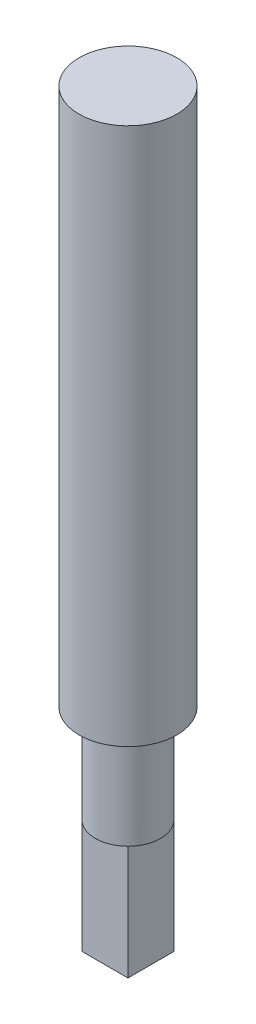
from build123d import *

# Parameters (mm, degrees)
SKETCH3_R           = 1.5
BOSS_EXTRUDE2_DEPTH = 16.5
SKETCH6_W           = 1
SKETCH6_H           = 4.5
CUT_EXTRUDE2_DEPTH  = 1
SKETCH7_R           = 1
BOSS_EXTRUDE3_DEPTH = 6.5
CUT_EXTRUDE3_START  = -3.5
CUT_EXTRUDE3_DEPTH  = 3.5


with BuildPart() as part:
    # Sketch3 → Boss-Extrude2 (new body)
    with BuildSketch(Plane(origin=(0, 0, 0), x_dir=(1, 0, 0), z_dir=(0, 1, 0))):
        with Locations(Location((1.5, 0, 0), (0, 0, 270))):
            Circle(SKETCH3_R)
    extrude(amount=BOSS_EXTRUDE2_DEPTH)

    # Sketch6 → Cut-Extrude2 (cut)
    with BuildSketch(Plane(origin=(0, 0, 0), x_dir=(0, 0, -1), z_dir=(1, 0, 0))):
        with Locations((0, 11.25)):
            Rectangle(SKETCH6_W, SKETCH6_H)
    extrude(amount=CUT_EXTRUDE2_DEPTH, mode=Mode.SUBTRACT)

    # Sketch7 → Boss-Extrude3 (add)
    with BuildSketch(Plane.XZ):
        with Locations(Location((1.5, 0, 0), (0, 0, 90))):
            Circle(SKETCH7_R)
    extrude(amount=BOSS_EXTRUDE3_DEPTH)

    # Sketch8 → Cut-Extrude3 (cut)
    with BuildSketch(Plane.XZ.offset(6.5).offset(CUT_EXTRUDE3_START)):
        with BuildLine():
            ThreePointArc((0.792893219, -0.707106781), (1.5, -1), (2.207106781, -0.707106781))
            Line((2.207106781, -0.707106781), (0.792893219, -0.707106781))
        make_face()
        with BuildLine():
            ThreePointArc((0.792893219, 0.707106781), (0.5, 0), (0.792893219, -0.707106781))
            Line((0.792893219, -0.707106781), (0.792893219, 0.707106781))
        make_face()
        with BuildLine():
            Line((0.792893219, 0.707106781), (2.207106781, 0.707106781))
            ThreePointArc((2.207106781, 0.707106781), (1.5, 1), (0.792893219, 0.707106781))
        make_face()
        with BuildLine():
            Line((2.207106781, 0.707106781), (2.207106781, -0.707106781))
            ThreePointArc((2.207106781, -0.707106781), (2.423879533, -0.382683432), (2.5, 0))
            ThreePointArc((2.5, 0), (2.423879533, 0.382683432), (2.207106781, 0.707106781))
        make_face()
    extrude(amount=CUT_EXTRUDE3_DEPTH, mode=Mode.SUBTRACT)


solid = part.part
